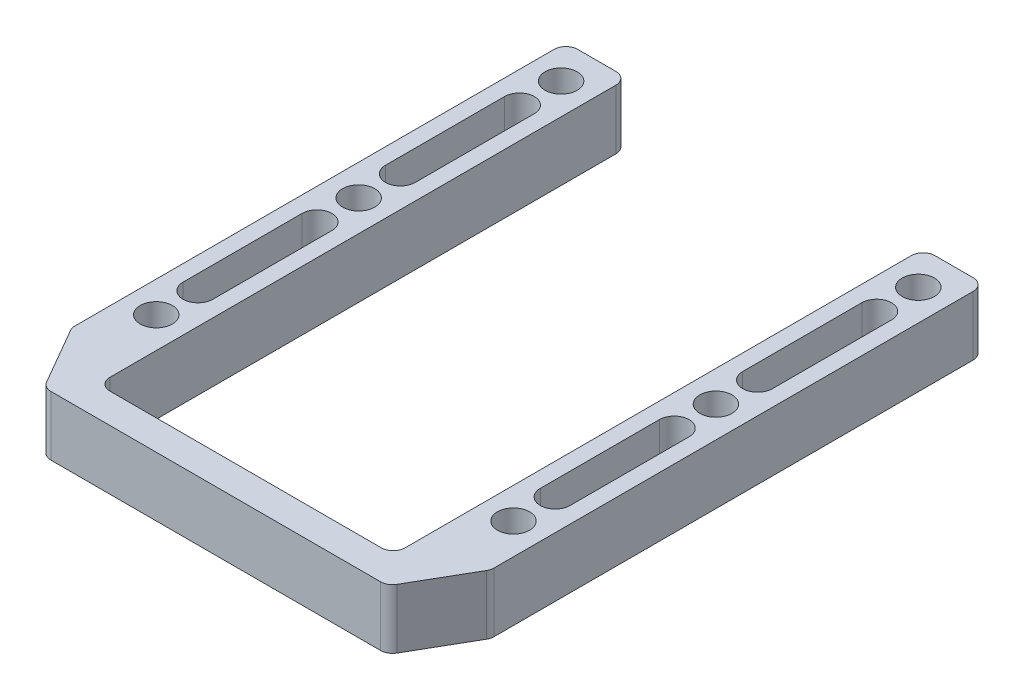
ISO-10303-21;
HEADER;
FILE_DESCRIPTION(('STEP AP214'),'2;1');
FILE_NAME('part.step','',(''),(''),'','','');
FILE_SCHEMA(('AUTOMOTIVE_DESIGN { 1 0 10303 214 1 1 1 1 }'));
ENDSEC;
DATA;
#1=APPLICATION_CONTEXT('core data for automotive mechanical design processes');
#2=APPLICATION_PROTOCOL_DEFINITION('international standard','automotive_design',2000,#1);
#3=PRODUCT_CONTEXT('',#1,'mechanical');
#4=PRODUCT('Part','Part','',(#3));
#5=PRODUCT_RELATED_PRODUCT_CATEGORY('part','',(#4));
#6=PRODUCT_DEFINITION_FORMATION('','',#4);
#7=PRODUCT_DEFINITION_CONTEXT('part definition',#1,'design');
#8=PRODUCT_DEFINITION('design','',#6,#7);
#9=PRODUCT_DEFINITION_SHAPE('','',#8);
#10=(LENGTH_UNIT() NAMED_UNIT(*) SI_UNIT(.MILLI.,.METRE.));
#11=(NAMED_UNIT(*) PLANE_ANGLE_UNIT() SI_UNIT($,.RADIAN.));
#12=(NAMED_UNIT(*) SI_UNIT($,.STERADIAN.) SOLID_ANGLE_UNIT());
#13=UNCERTAINTY_MEASURE_WITH_UNIT(LENGTH_MEASURE(1.E-05),#10,'distance_accuracy_value','');
#14=(GEOMETRIC_REPRESENTATION_CONTEXT(3) GLOBAL_UNCERTAINTY_ASSIGNED_CONTEXT((#13)) GLOBAL_UNIT_ASSIGNED_CONTEXT((#10,
#11,#12)) REPRESENTATION_CONTEXT('',''));
#15=CARTESIAN_POINT('',(0.,0.,0.));
#16=DIRECTION('',(0.,0.,1.));
#17=DIRECTION('',(1.,0.,0.));
#18=AXIS2_PLACEMENT_3D('',#15,#16,#17);
#19=CARTESIAN_POINT('',(48.4,20.5,11.));
#20=DIRECTION('',(0.,-1.,0.));
#21=DIRECTION('',(1.,0.,0.));
#22=AXIS2_PLACEMENT_3D('',#19,#20,#21);
#23=CYLINDRICAL_SURFACE('',#22,1.);
#24=DIRECTION('',(0.,1.,0.));
#25=VECTOR('',#24,1.);
#26=CARTESIAN_POINT('',(49.4,15.,11.));
#27=LINE('',#26,#25);
#28=CARTESIAN_POINT('',(49.4,15.,11.));
#29=VERTEX_POINT('',#28);
#30=CARTESIAN_POINT('',(49.4,20.,11.));
#31=VERTEX_POINT('',#30);
#32=EDGE_CURVE('E220',#29,#31,#27,.T.);
#33=ORIENTED_EDGE('',*,*,#32,.F.);
#34=CARTESIAN_POINT('',(48.4,15.,11.));
#35=DIRECTION('',(0.,-1.,0.));
#36=DIRECTION('',(1.,0.,0.));
#37=AXIS2_PLACEMENT_3D('',#34,#35,#36);
#38=CIRCLE('',#37,1.);
#39=CARTESIAN_POINT('',(48.4,15.,12.));
#40=VERTEX_POINT('',#39);
#41=EDGE_CURVE('E21',#40,#29,#38,.F.);
#42=ORIENTED_EDGE('',*,*,#41,.F.);
#43=DIRECTION('',(0.,1.,0.));
#44=VECTOR('',#43,1.);
#45=CARTESIAN_POINT('',(48.4,15.,12.));
#46=LINE('',#45,#44);
#47=CARTESIAN_POINT('',(48.4,20.,12.));
#48=VERTEX_POINT('',#47);
#49=EDGE_CURVE('E224',#48,#40,#46,.F.);
#50=ORIENTED_EDGE('',*,*,#49,.F.);
#51=CARTESIAN_POINT('',(48.4,20.,11.));
#52=DIRECTION('',(0.,-1.,0.));
#53=DIRECTION('',(1.,0.,0.));
#54=AXIS2_PLACEMENT_3D('',#51,#52,#53);
#55=CIRCLE('',#54,1.);
#56=EDGE_CURVE('E363',#31,#48,#55,.T.);
#57=ORIENTED_EDGE('',*,*,#56,.F.);
#58=EDGE_LOOP('',(#33,#42,#50,#57));
#59=FACE_BOUND('',#58,.T.);
#60=ADVANCED_FACE('F17',(#59),#23,.F.);
#61=CARTESIAN_POINT('',(50.4,14.5,-31.5));
#62=DIRECTION('',(0.,1.,0.));
#63=DIRECTION('',(0.,0.,1.));
#64=AXIS2_PLACEMENT_3D('',#61,#62,#63);
#65=CYLINDRICAL_SURFACE('',#64,1.);
#66=DIRECTION('',(0.,1.,0.));
#67=VECTOR('',#66,1.);
#68=CARTESIAN_POINT('',(50.4,15.,-32.5));
#69=LINE('',#68,#67);
#70=CARTESIAN_POINT('',(50.4,15.,-32.5));
#71=VERTEX_POINT('',#70);
#72=CARTESIAN_POINT('',(50.4,20.,-32.5));
#73=VERTEX_POINT('',#72);
#74=EDGE_CURVE('E215',#71,#73,#69,.T.);
#75=ORIENTED_EDGE('',*,*,#74,.F.);
#76=CARTESIAN_POINT('',(50.4,15.,-31.5));
#77=DIRECTION('',(0.,1.,0.));
#78=DIRECTION('',(0.,0.,1.));
#79=AXIS2_PLACEMENT_3D('',#76,#77,#78);
#80=CIRCLE('',#79,1.);
#81=CARTESIAN_POINT('',(49.4,15.,-31.5));
#82=VERTEX_POINT('',#81);
#83=EDGE_CURVE('E390',#71,#82,#80,.T.);
#84=ORIENTED_EDGE('',*,*,#83,.T.);
#85=DIRECTION('',(0.,1.,0.));
#86=VECTOR('',#85,1.);
#87=CARTESIAN_POINT('',(49.4,15.,-31.5));
#88=LINE('',#87,#86);
#89=CARTESIAN_POINT('',(49.4,20.,-31.5));
#90=VERTEX_POINT('',#89);
#91=EDGE_CURVE('E219',#90,#82,#88,.F.);
#92=ORIENTED_EDGE('',*,*,#91,.F.);
#93=CARTESIAN_POINT('',(50.4,20.,-31.5));
#94=DIRECTION('',(0.,1.,0.));
#95=DIRECTION('',(0.,0.,1.));
#96=AXIS2_PLACEMENT_3D('',#93,#94,#95);
#97=CIRCLE('',#96,1.);
#98=EDGE_CURVE('E365',#73,#90,#97,.T.);
#99=ORIENTED_EDGE('',*,*,#98,.F.);
#100=EDGE_LOOP('',(#75,#84,#92,#99));
#101=FACE_BOUND('',#100,.T.);
#102=ADVANCED_FACE('F617',(#101),#65,.T.);
#103=CARTESIAN_POINT('',(53.6,14.5,-31.5));
#104=DIRECTION('',(0.,1.,0.));
#105=DIRECTION('',(0.,0.,1.));
#106=AXIS2_PLACEMENT_3D('',#103,#104,#105);
#107=CYLINDRICAL_SURFACE('',#106,1.00000000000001);
#108=DIRECTION('',(0.,1.,0.));
#109=VECTOR('',#108,1.);
#110=CARTESIAN_POINT('',(54.6,15.,-31.5));
#111=LINE('',#110,#109);
#112=CARTESIAN_POINT('',(54.6,15.,-31.5));
#113=VERTEX_POINT('',#112);
#114=CARTESIAN_POINT('',(54.6,20.,-31.5));
#115=VERTEX_POINT('',#114);
#116=EDGE_CURVE('E210',#113,#115,#111,.T.);
#117=ORIENTED_EDGE('',*,*,#116,.F.);
#118=CARTESIAN_POINT('',(53.6,15.,-31.5));
#119=DIRECTION('',(0.,1.,0.));
#120=DIRECTION('',(0.,0.,1.));
#121=AXIS2_PLACEMENT_3D('',#118,#119,#120);
#122=CIRCLE('',#121,1.00000000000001);
#123=CARTESIAN_POINT('',(53.6,15.,-32.5));
#124=VERTEX_POINT('',#123);
#125=EDGE_CURVE('E389',#113,#124,#122,.T.);
#126=ORIENTED_EDGE('',*,*,#125,.T.);
#127=DIRECTION('',(0.,1.,0.));
#128=VECTOR('',#127,1.);
#129=CARTESIAN_POINT('',(53.6,15.,-32.5));
#130=LINE('',#129,#128);
#131=CARTESIAN_POINT('',(53.6,20.,-32.5));
#132=VERTEX_POINT('',#131);
#133=EDGE_CURVE('E214',#132,#124,#130,.F.);
#134=ORIENTED_EDGE('',*,*,#133,.F.);
#135=CARTESIAN_POINT('',(53.6,20.,-31.5));
#136=DIRECTION('',(0.,1.,0.));
#137=DIRECTION('',(0.,0.,1.));
#138=AXIS2_PLACEMENT_3D('',#135,#136,#137);
#139=CIRCLE('',#138,1.00000000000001);
#140=EDGE_CURVE('E367',#115,#132,#139,.T.);
#141=ORIENTED_EDGE('',*,*,#140,.F.);
#142=EDGE_LOOP('',(#117,#126,#134,#141));
#143=FACE_BOUND('',#142,.T.);
#144=ADVANCED_FACE('F614',(#143),#107,.T.);
#145=CARTESIAN_POINT('',(53.6000000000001,14.5,8.73205080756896));
#146=DIRECTION('',(0.,1.,0.));
#147=DIRECTION('',(0.,0.,1.));
#148=AXIS2_PLACEMENT_3D('',#145,#146,#147);
#149=CYLINDRICAL_SURFACE('',#148,0.999999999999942);
#150=DIRECTION('',(0.,1.,0.));
#151=VECTOR('',#150,1.);
#152=CARTESIAN_POINT('',(54.4660254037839,15.,9.23205080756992));
#153=LINE('',#152,#151);
#154=CARTESIAN_POINT('',(54.4660254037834,15.,9.23205080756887));
#155=VERTEX_POINT('',#154);
#156=CARTESIAN_POINT('',(54.4660254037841,20.,9.23205080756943));
#157=VERTEX_POINT('',#156);
#158=EDGE_CURVE('E205',#155,#157,#153,.T.);
#159=ORIENTED_EDGE('',*,*,#158,.F.);
#160=CARTESIAN_POINT('',(53.6000000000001,15.,8.73205080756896));
#161=DIRECTION('',(0.,1.,0.));
#162=DIRECTION('',(0.,0.,1.));
#163=AXIS2_PLACEMENT_3D('',#160,#161,#162);
#164=CIRCLE('',#163,0.999999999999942);
#165=CARTESIAN_POINT('',(54.6,15.,8.73205080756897));
#166=VERTEX_POINT('',#165);
#167=EDGE_CURVE('E387',#155,#166,#164,.T.);
#168=ORIENTED_EDGE('',*,*,#167,.T.);
#169=DIRECTION('',(0.,1.,0.));
#170=VECTOR('',#169,1.);
#171=CARTESIAN_POINT('',(54.6,15.,8.73205080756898));
#172=LINE('',#171,#170);
#173=CARTESIAN_POINT('',(54.6,20.,8.73205080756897));
#174=VERTEX_POINT('',#173);
#175=EDGE_CURVE('E209',#174,#166,#172,.F.);
#176=ORIENTED_EDGE('',*,*,#175,.F.);
#177=CARTESIAN_POINT('',(53.6000000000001,20.,8.73205080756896));
#178=DIRECTION('',(0.,1.,0.));
#179=DIRECTION('',(0.,0.,1.));
#180=AXIS2_PLACEMENT_3D('',#177,#178,#179);
#181=CIRCLE('',#180,0.999999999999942);
#182=EDGE_CURVE('E369',#157,#174,#181,.T.);
#183=ORIENTED_EDGE('',*,*,#182,.F.);
#184=EDGE_LOOP('',(#159,#168,#176,#183));
#185=FACE_BOUND('',#184,.T.);
#186=ADVANCED_FACE('F623',(#185),#149,.T.);
#187=CARTESIAN_POINT('',(50.84722325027,14.5,13.5000000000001));
#188=DIRECTION('',(0.,1.,0.));
#189=DIRECTION('',(0.,0.,1.));
#190=AXIS2_PLACEMENT_3D('',#187,#188,#189);
#191=CYLINDRICAL_SURFACE('',#190,0.999999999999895);
#192=DIRECTION('',(0.,1.,0.));
#193=VECTOR('',#192,1.);
#194=CARTESIAN_POINT('',(50.84722325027,15.,14.5));
#195=LINE('',#194,#193);
#196=CARTESIAN_POINT('',(50.84722325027,15.,14.5));
#197=VERTEX_POINT('',#196);
#198=CARTESIAN_POINT('',(50.84722325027,20.,14.5));
#199=VERTEX_POINT('',#198);
#200=EDGE_CURVE('E200',#197,#199,#195,.T.);
#201=ORIENTED_EDGE('',*,*,#200,.F.);
#202=CARTESIAN_POINT('',(50.84722325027,15.,13.5000000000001));
#203=DIRECTION('',(0.,1.,0.));
#204=DIRECTION('',(0.,0.,1.));
#205=AXIS2_PLACEMENT_3D('',#202,#203,#204);
#206=CIRCLE('',#205,0.999999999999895);
#207=CARTESIAN_POINT('',(51.713248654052,15.,13.9999999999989));
#208=VERTEX_POINT('',#207);
#209=EDGE_CURVE('E385',#197,#208,#206,.T.);
#210=ORIENTED_EDGE('',*,*,#209,.T.);
#211=DIRECTION('',(0.,1.,0.));
#212=VECTOR('',#211,1.);
#213=CARTESIAN_POINT('',(51.7132486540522,15.,13.9999999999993));
#214=LINE('',#213,#212);
#215=CARTESIAN_POINT('',(51.7132486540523,20.,13.9999999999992));
#216=VERTEX_POINT('',#215);
#217=EDGE_CURVE('E204',#216,#208,#214,.F.);
#218=ORIENTED_EDGE('',*,*,#217,.F.);
#219=CARTESIAN_POINT('',(50.84722325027,20.,13.5000000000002));
#220=DIRECTION('',(0.,1.,0.));
#221=DIRECTION('',(0.,0.,1.));
#222=AXIS2_PLACEMENT_3D('',#219,#220,#221);
#223=CIRCLE('',#222,0.999999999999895);
#224=EDGE_CURVE('E371',#199,#216,#223,.T.);
#225=ORIENTED_EDGE('',*,*,#224,.F.);
#226=EDGE_LOOP('',(#201,#210,#218,#225));
#227=FACE_BOUND('',#226,.T.);
#228=ADVANCED_FACE('F630',(#227),#191,.T.);
#229=CARTESIAN_POINT('',(23.15277674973,14.5,13.5000000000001));
#230=DIRECTION('',(0.,1.,0.));
#231=DIRECTION('',(0.,0.,1.));
#232=AXIS2_PLACEMENT_3D('',#229,#230,#231);
#233=CYLINDRICAL_SURFACE('',#232,0.999999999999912);
#234=DIRECTION('',(0.,1.,0.));
#235=VECTOR('',#234,1.);
#236=CARTESIAN_POINT('',(22.2867513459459,15.,14.0000000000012));
#237=LINE('',#236,#235);
#238=CARTESIAN_POINT('',(22.2867513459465,15.,14.0000000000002));
#239=VERTEX_POINT('',#238);
#240=CARTESIAN_POINT('',(22.2867513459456,20.,14.0000000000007));
#241=VERTEX_POINT('',#240);
#242=EDGE_CURVE('E195',#239,#241,#237,.T.);
#243=ORIENTED_EDGE('',*,*,#242,.F.);
#244=CARTESIAN_POINT('',(23.15277674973,15.,13.5000000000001));
#245=DIRECTION('',(0.,1.,0.));
#246=DIRECTION('',(0.,0.,1.));
#247=AXIS2_PLACEMENT_3D('',#244,#245,#246);
#248=CIRCLE('',#247,0.999999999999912);
#249=CARTESIAN_POINT('',(23.15277674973,15.,14.5));
#250=VERTEX_POINT('',#249);
#251=EDGE_CURVE('E383',#239,#250,#248,.T.);
#252=ORIENTED_EDGE('',*,*,#251,.T.);
#253=DIRECTION('',(0.,1.,0.));
#254=VECTOR('',#253,1.);
#255=CARTESIAN_POINT('',(23.15277674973,15.,14.5));
#256=LINE('',#255,#254);
#257=CARTESIAN_POINT('',(23.15277674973,20.,14.5));
#258=VERTEX_POINT('',#257);
#259=EDGE_CURVE('E199',#258,#250,#256,.F.);
#260=ORIENTED_EDGE('',*,*,#259,.F.);
#261=CARTESIAN_POINT('',(23.15277674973,20.,13.5000000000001));
#262=DIRECTION('',(0.,1.,0.));
#263=DIRECTION('',(0.,0.,1.));
#264=AXIS2_PLACEMENT_3D('',#261,#262,#263);
#265=CIRCLE('',#264,0.999999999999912);
#266=EDGE_CURVE('E373',#241,#258,#265,.T.);
#267=ORIENTED_EDGE('',*,*,#266,.F.);
#268=EDGE_LOOP('',(#243,#252,#260,#267));
#269=FACE_BOUND('',#268,.T.);
#270=ADVANCED_FACE('F634',(#269),#233,.T.);
#271=CARTESIAN_POINT('',(20.3999999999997,14.5,8.73205080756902));
#272=DIRECTION('',(0.,1.,0.));
#273=DIRECTION('',(0.,0.,1.));
#274=AXIS2_PLACEMENT_3D('',#271,#272,#273);
#275=CYLINDRICAL_SURFACE('',#274,0.99999999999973);
#276=DIRECTION('',(0.,1.,0.));
#277=VECTOR('',#276,1.);
#278=CARTESIAN_POINT('',(19.4,15.,8.73205080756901));
#279=LINE('',#278,#277);
#280=CARTESIAN_POINT('',(19.4,15.,8.73205080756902));
#281=VERTEX_POINT('',#280);
#282=CARTESIAN_POINT('',(19.4,20.,8.73205080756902));
#283=VERTEX_POINT('',#282);
#284=EDGE_CURVE('E190',#281,#283,#279,.T.);
#285=ORIENTED_EDGE('',*,*,#284,.F.);
#286=CARTESIAN_POINT('',(20.3999999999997,15.,8.73205080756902));
#287=DIRECTION('',(0.,1.,0.));
#288=DIRECTION('',(0.,0.,1.));
#289=AXIS2_PLACEMENT_3D('',#286,#287,#288);
#290=CIRCLE('',#289,0.99999999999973);
#291=CARTESIAN_POINT('',(19.5339745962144,15.,9.2320508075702));
#292=VERTEX_POINT('',#291);
#293=EDGE_CURVE('E381',#281,#292,#290,.T.);
#294=ORIENTED_EDGE('',*,*,#293,.T.);
#295=DIRECTION('',(0.,1.,0.));
#296=VECTOR('',#295,1.);
#297=CARTESIAN_POINT('',(19.5339745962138,15.,9.23205080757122));
#298=LINE('',#297,#296);
#299=CARTESIAN_POINT('',(19.5339745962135,20.,9.23205080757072));
#300=VERTEX_POINT('',#299);
#301=EDGE_CURVE('E194',#300,#292,#298,.F.);
#302=ORIENTED_EDGE('',*,*,#301,.F.);
#303=CARTESIAN_POINT('',(20.3999999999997,20.,8.73205080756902));
#304=DIRECTION('',(0.,1.,0.));
#305=DIRECTION('',(0.,0.,1.));
#306=AXIS2_PLACEMENT_3D('',#303,#304,#305);
#307=CIRCLE('',#306,0.99999999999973);
#308=EDGE_CURVE('E375',#283,#300,#307,.T.);
#309=ORIENTED_EDGE('',*,*,#308,.F.);
#310=EDGE_LOOP('',(#285,#294,#302,#309));
#311=FACE_BOUND('',#310,.T.);
#312=ADVANCED_FACE('F638',(#311),#275,.T.);
#313=CARTESIAN_POINT('',(20.4,14.5,-31.5));
#314=DIRECTION('',(0.,1.,0.));
#315=DIRECTION('',(0.,0.,1.));
#316=AXIS2_PLACEMENT_3D('',#313,#314,#315);
#317=CYLINDRICAL_SURFACE('',#316,1.);
#318=DIRECTION('',(0.,1.,0.));
#319=VECTOR('',#318,1.);
#320=CARTESIAN_POINT('',(20.4,15.,-32.5));
#321=LINE('',#320,#319);
#322=CARTESIAN_POINT('',(20.4,15.,-32.5));
#323=VERTEX_POINT('',#322);
#324=CARTESIAN_POINT('',(20.4,20.,-32.5));
#325=VERTEX_POINT('',#324);
#326=EDGE_CURVE('E180',#323,#325,#321,.T.);
#327=ORIENTED_EDGE('',*,*,#326,.F.);
#328=CARTESIAN_POINT('',(20.4,15.,-31.5));
#329=DIRECTION('',(0.,1.,0.));
#330=DIRECTION('',(0.,0.,1.));
#331=AXIS2_PLACEMENT_3D('',#328,#329,#330);
#332=CIRCLE('',#331,1.);
#333=CARTESIAN_POINT('',(19.4,15.,-31.5));
#334=VERTEX_POINT('',#333);
#335=EDGE_CURVE('E379',#323,#334,#332,.T.);
#336=ORIENTED_EDGE('',*,*,#335,.T.);
#337=DIRECTION('',(0.,1.,0.));
#338=VECTOR('',#337,1.);
#339=CARTESIAN_POINT('',(19.4,15.,-31.5));
#340=LINE('',#339,#338);
#341=CARTESIAN_POINT('',(19.4,20.,-31.5));
#342=VERTEX_POINT('',#341);
#343=EDGE_CURVE('E182',#342,#334,#340,.F.);
#344=ORIENTED_EDGE('',*,*,#343,.F.);
#345=CARTESIAN_POINT('',(20.4,20.,-31.5));
#346=DIRECTION('',(0.,1.,0.));
#347=DIRECTION('',(0.,0.,1.));
#348=AXIS2_PLACEMENT_3D('',#345,#346,#347);
#349=CIRCLE('',#348,1.);
#350=EDGE_CURVE('E169',#325,#342,#349,.T.);
#351=ORIENTED_EDGE('',*,*,#350,.F.);
#352=EDGE_LOOP('',(#327,#336,#344,#351));
#353=FACE_BOUND('',#352,.T.);
#354=ADVANCED_FACE('F642',(#353),#317,.T.);
#355=CARTESIAN_POINT('',(23.6,14.5,-31.5));
#356=DIRECTION('',(0.,1.,0.));
#357=DIRECTION('',(0.,0.,1.));
#358=AXIS2_PLACEMENT_3D('',#355,#356,#357);
#359=CYLINDRICAL_SURFACE('',#358,1.);
#360=DIRECTION('',(0.,1.,0.));
#361=VECTOR('',#360,1.);
#362=CARTESIAN_POINT('',(24.6,15.,-31.5));
#363=LINE('',#362,#361);
#364=CARTESIAN_POINT('',(24.6,15.,-31.5));
#365=VERTEX_POINT('',#364);
#366=CARTESIAN_POINT('',(24.6,20.,-31.5));
#367=VERTEX_POINT('',#366);
#368=EDGE_CURVE('E176',#365,#367,#363,.T.);
#369=ORIENTED_EDGE('',*,*,#368,.F.);
#370=CARTESIAN_POINT('',(23.6,15.,-31.5));
#371=DIRECTION('',(0.,1.,0.));
#372=DIRECTION('',(0.,0.,1.));
#373=AXIS2_PLACEMENT_3D('',#370,#371,#372);
#374=CIRCLE('',#373,1.);
#375=CARTESIAN_POINT('',(23.6,15.,-32.5));
#376=VERTEX_POINT('',#375);
#377=EDGE_CURVE('E35',#365,#376,#374,.T.);
#378=ORIENTED_EDGE('',*,*,#377,.T.);
#379=DIRECTION('',(0.,1.,0.));
#380=VECTOR('',#379,1.);
#381=CARTESIAN_POINT('',(23.6,15.,-32.5));
#382=LINE('',#381,#380);
#383=CARTESIAN_POINT('',(23.6,20.,-32.5));
#384=VERTEX_POINT('',#383);
#385=EDGE_CURVE('E172',#384,#376,#382,.F.);
#386=ORIENTED_EDGE('',*,*,#385,.F.);
#387=CARTESIAN_POINT('',(23.6,20.,-31.5));
#388=DIRECTION('',(0.,1.,0.));
#389=DIRECTION('',(0.,0.,1.));
#390=AXIS2_PLACEMENT_3D('',#387,#388,#389);
#391=CIRCLE('',#390,1.);
#392=EDGE_CURVE('E156',#367,#384,#391,.T.);
#393=ORIENTED_EDGE('',*,*,#392,.F.);
#394=EDGE_LOOP('',(#369,#378,#386,#393));
#395=FACE_BOUND('',#394,.T.);
#396=ADVANCED_FACE('F173',(#395),#359,.T.);
#397=CARTESIAN_POINT('',(54.6,20.,14.5));
#398=DIRECTION('',(0.,1.,0.));
#399=DIRECTION('',(0.,0.,1.));
#400=AXIS2_PLACEMENT_3D('',#397,#398,#399);
#401=PLANE('',#400);
#402=CARTESIAN_POINT('',(22.,20.,-26.));
#403=DIRECTION('',(0.,-1.,0.));
#404=DIRECTION('',(0.,0.,-1.));
#405=AXIS2_PLACEMENT_3D('',#402,#403,#404);
#406=CIRCLE('',#405,1.25);
#407=CARTESIAN_POINT('',(20.75,20.,-26.));
#408=VERTEX_POINT('',#407);
#409=CARTESIAN_POINT('',(23.25,20.,-26.));
#410=VERTEX_POINT('',#409);
#411=EDGE_CURVE('E357',#408,#410,#406,.T.);
#412=ORIENTED_EDGE('',*,*,#411,.T.);
#413=DIRECTION('',(0.,0.,1.));
#414=VECTOR('',#413,1.);
#415=CARTESIAN_POINT('',(23.25,20.,-16.));
#416=LINE('',#415,#414);
#417=CARTESIAN_POINT('',(23.25,20.,-16.));
#418=VERTEX_POINT('',#417);
#419=EDGE_CURVE('E255',#418,#410,#416,.F.);
#420=ORIENTED_EDGE('',*,*,#419,.F.);
#421=CARTESIAN_POINT('',(22.,20.,-16.));
#422=DIRECTION('',(0.,-1.,0.));
#423=DIRECTION('',(0.,0.,-1.));
#424=AXIS2_PLACEMENT_3D('',#421,#422,#423);
#425=CIRCLE('',#424,1.25);
#426=CARTESIAN_POINT('',(20.75,20.,-16.));
#427=VERTEX_POINT('',#426);
#428=EDGE_CURVE('E263',#418,#427,#425,.T.);
#429=ORIENTED_EDGE('',*,*,#428,.T.);
#430=DIRECTION('',(0.,0.,-1.));
#431=VECTOR('',#430,1.);
#432=CARTESIAN_POINT('',(20.75,20.,-26.));
#433=LINE('',#432,#431);
#434=EDGE_CURVE('E260',#408,#427,#433,.F.);
#435=ORIENTED_EDGE('',*,*,#434,.F.);
#436=EDGE_LOOP('',(#412,#420,#429,#435));
#437=FACE_BOUND('',#436,.T.);
#438=CARTESIAN_POINT('',(22.,20.,-9.));
#439=DIRECTION('',(0.,-1.,0.));
#440=DIRECTION('',(0.,0.,-1.));
#441=AXIS2_PLACEMENT_3D('',#438,#439,#440);
#442=CIRCLE('',#441,1.25);
#443=CARTESIAN_POINT('',(20.75,20.,-9.));
#444=VERTEX_POINT('',#443);
#445=CARTESIAN_POINT('',(23.25,20.,-9.));
#446=VERTEX_POINT('',#445);
#447=EDGE_CURVE('E351',#444,#446,#442,.T.);
#448=ORIENTED_EDGE('',*,*,#447,.T.);
#449=DIRECTION('',(0.,0.,1.));
#450=VECTOR('',#449,1.);
#451=CARTESIAN_POINT('',(23.25,20.,1.));
#452=LINE('',#451,#450);
#453=CARTESIAN_POINT('',(23.25,20.,1.));
#454=VERTEX_POINT('',#453);
#455=EDGE_CURVE('E246',#454,#446,#452,.F.);
#456=ORIENTED_EDGE('',*,*,#455,.F.);
#457=CARTESIAN_POINT('',(22.,20.,1.));
#458=DIRECTION('',(0.,-1.,0.));
#459=DIRECTION('',(0.,0.,-1.));
#460=AXIS2_PLACEMENT_3D('',#457,#458,#459);
#461=CIRCLE('',#460,1.25);
#462=CARTESIAN_POINT('',(20.75,20.,1.));
#463=VERTEX_POINT('',#462);
#464=EDGE_CURVE('E253',#454,#463,#461,.T.);
#465=ORIENTED_EDGE('',*,*,#464,.T.);
#466=DIRECTION('',(0.,0.,-1.));
#467=VECTOR('',#466,1.);
#468=CARTESIAN_POINT('',(20.75,20.,-9.));
#469=LINE('',#468,#467);
#470=EDGE_CURVE('E250',#444,#463,#469,.F.);
#471=ORIENTED_EDGE('',*,*,#470,.F.);
#472=EDGE_LOOP('',(#448,#456,#465,#471));
#473=FACE_BOUND('',#472,.T.);
#474=DIRECTION('',(0.,0.,-1.));
#475=VECTOR('',#474,1.);
#476=CARTESIAN_POINT('',(50.75,20.,-26.));
#477=LINE('',#476,#475);
#478=CARTESIAN_POINT('',(50.75,20.,-26.));
#479=VERTEX_POINT('',#478);
#480=CARTESIAN_POINT('',(50.75,20.,-16.));
#481=VERTEX_POINT('',#480);
#482=EDGE_CURVE('E241',#479,#481,#477,.F.);
#483=ORIENTED_EDGE('',*,*,#482,.F.);
#484=CARTESIAN_POINT('',(52.,20.,-26.));
#485=DIRECTION('',(0.,-1.,0.));
#486=DIRECTION('',(0.,0.,-1.));
#487=AXIS2_PLACEMENT_3D('',#484,#485,#486);
#488=CIRCLE('',#487,1.25);
#489=CARTESIAN_POINT('',(53.25,20.,-26.));
#490=VERTEX_POINT('',#489);
#491=EDGE_CURVE('E342',#479,#490,#488,.T.);
#492=ORIENTED_EDGE('',*,*,#491,.T.);
#493=DIRECTION('',(0.,0.,1.));
#494=VECTOR('',#493,1.);
#495=CARTESIAN_POINT('',(53.25,20.,-16.));
#496=LINE('',#495,#494);
#497=CARTESIAN_POINT('',(53.25,20.,-16.));
#498=VERTEX_POINT('',#497);
#499=EDGE_CURVE('E236',#498,#490,#496,.F.);
#500=ORIENTED_EDGE('',*,*,#499,.F.);
#501=CARTESIAN_POINT('',(52.,20.,-16.));
#502=DIRECTION('',(0.,-1.,0.));
#503=DIRECTION('',(0.,0.,-1.));
#504=AXIS2_PLACEMENT_3D('',#501,#502,#503);
#505=CIRCLE('',#504,1.25);
#506=EDGE_CURVE('E244',#498,#481,#505,.T.);
#507=ORIENTED_EDGE('',*,*,#506,.T.);
#508=EDGE_LOOP('',(#483,#492,#500,#507));
#509=FACE_BOUND('',#508,.T.);
#510=DIRECTION('',(0.,0.,-1.));
#511=VECTOR('',#510,1.);
#512=CARTESIAN_POINT('',(50.75,20.,-9.));
#513=LINE('',#512,#511);
#514=CARTESIAN_POINT('',(50.75,20.,-9.));
#515=VERTEX_POINT('',#514);
#516=CARTESIAN_POINT('',(50.75,20.,1.));
#517=VERTEX_POINT('',#516);
#518=EDGE_CURVE('E231',#515,#517,#513,.F.);
#519=ORIENTED_EDGE('',*,*,#518,.F.);
#520=CARTESIAN_POINT('',(52.,20.,-9.));
#521=DIRECTION('',(0.,-1.,0.));
#522=DIRECTION('',(0.,0.,-1.));
#523=AXIS2_PLACEMENT_3D('',#520,#521,#522);
#524=CIRCLE('',#523,1.25);
#525=CARTESIAN_POINT('',(53.25,20.,-9.));
#526=VERTEX_POINT('',#525);
#527=EDGE_CURVE('E336',#515,#526,#524,.T.);
#528=ORIENTED_EDGE('',*,*,#527,.T.);
#529=DIRECTION('',(0.,0.,1.));
#530=VECTOR('',#529,1.);
#531=CARTESIAN_POINT('',(53.25,20.,1.));
#532=LINE('',#531,#530);
#533=CARTESIAN_POINT('',(53.25,20.,0.999999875));
#534=VERTEX_POINT('',#533);
#535=EDGE_CURVE('E226',#534,#526,#532,.F.);
#536=ORIENTED_EDGE('',*,*,#535,.F.);
#537=CARTESIAN_POINT('',(52.,20.,1.));
#538=DIRECTION('',(0.,-1.,0.));
#539=DIRECTION('',(0.,0.,-1.));
#540=AXIS2_PLACEMENT_3D('',#537,#538,#539);
#541=CIRCLE('',#540,1.25);
#542=EDGE_CURVE('E234',#534,#517,#541,.T.);
#543=ORIENTED_EDGE('',*,*,#542,.T.);
#544=EDGE_LOOP('',(#519,#528,#536,#543));
#545=FACE_BOUND('',#544,.T.);
#546=CARTESIAN_POINT('',(22.,20.,-12.5));
#547=DIRECTION('',(0.,-1.,0.));
#548=DIRECTION('',(0.,0.,-1.));
#549=AXIS2_PLACEMENT_3D('',#546,#547,#548);
#550=CIRCLE('',#549,1.35);
#551=CARTESIAN_POINT('',(22.,20.,-13.85));
#552=VERTEX_POINT('',#551);
#553=EDGE_CURVE('E332',#552,#552,#550,.T.);
#554=ORIENTED_EDGE('',*,*,#553,.T.);
#555=EDGE_LOOP('',(#554));
#556=FACE_BOUND('',#555,.T.);
#557=CARTESIAN_POINT('',(22.,20.,4.5));
#558=DIRECTION('',(0.,-1.,0.));
#559=DIRECTION('',(0.,0.,-1.));
#560=AXIS2_PLACEMENT_3D('',#557,#558,#559);
#561=CIRCLE('',#560,1.35);
#562=CARTESIAN_POINT('',(22.,20.,3.15));
#563=VERTEX_POINT('',#562);
#564=EDGE_CURVE('E329',#563,#563,#561,.T.);
#565=ORIENTED_EDGE('',*,*,#564,.T.);
#566=EDGE_LOOP('',(#565));
#567=FACE_BOUND('',#566,.T.);
#568=CARTESIAN_POINT('',(22.,20.,-29.5));
#569=DIRECTION('',(0.,-1.,0.));
#570=DIRECTION('',(0.,0.,-1.));
#571=AXIS2_PLACEMENT_3D('',#568,#569,#570);
#572=CIRCLE('',#571,1.35);
#573=CARTESIAN_POINT('',(22.,20.,-30.85));
#574=VERTEX_POINT('',#573);
#575=EDGE_CURVE('E326',#574,#574,#572,.T.);
#576=ORIENTED_EDGE('',*,*,#575,.T.);
#577=EDGE_LOOP('',(#576));
#578=FACE_BOUND('',#577,.T.);
#579=CARTESIAN_POINT('',(52.,20.,-12.5));
#580=DIRECTION('',(0.,-1.,0.));
#581=DIRECTION('',(0.,0.,-1.));
#582=AXIS2_PLACEMENT_3D('',#579,#580,#581);
#583=CIRCLE('',#582,1.35);
#584=CARTESIAN_POINT('',(52.,20.,-13.85));
#585=VERTEX_POINT('',#584);
#586=EDGE_CURVE('E323',#585,#585,#583,.T.);
#587=ORIENTED_EDGE('',*,*,#586,.T.);
#588=EDGE_LOOP('',(#587));
#589=FACE_BOUND('',#588,.T.);
#590=CARTESIAN_POINT('',(52.,20.,4.5));
#591=DIRECTION('',(0.,-1.,0.));
#592=DIRECTION('',(0.,0.,-1.));
#593=AXIS2_PLACEMENT_3D('',#590,#591,#592);
#594=CIRCLE('',#593,1.35);
#595=CARTESIAN_POINT('',(52.,20.,3.15));
#596=VERTEX_POINT('',#595);
#597=EDGE_CURVE('E320',#596,#596,#594,.T.);
#598=ORIENTED_EDGE('',*,*,#597,.T.);
#599=EDGE_LOOP('',(#598));
#600=FACE_BOUND('',#599,.T.);
#601=CARTESIAN_POINT('',(52.,20.,-29.5));
#602=DIRECTION('',(0.,-1.,0.));
#603=DIRECTION('',(0.,0.,-1.));
#604=AXIS2_PLACEMENT_3D('',#601,#602,#603);
#605=CIRCLE('',#604,1.35);
#606=CARTESIAN_POINT('',(52.,20.,-30.85));
#607=VERTEX_POINT('',#606);
#608=EDGE_CURVE('E317',#607,#607,#605,.T.);
#609=ORIENTED_EDGE('',*,*,#608,.T.);
#610=EDGE_LOOP('',(#609));
#611=FACE_BOUND('',#610,.T.);
#612=ORIENTED_EDGE('',*,*,#56,.T.);
#613=DIRECTION('',(-1.,0.,0.));
#614=VECTOR('',#613,1.);
#615=CARTESIAN_POINT('',(48.4,20.,12.));
#616=LINE('',#615,#614);
#617=CARTESIAN_POINT('',(25.6,20.,12.));
#618=VERTEX_POINT('',#617);
#619=EDGE_CURVE('E221',#618,#48,#616,.F.);
#620=ORIENTED_EDGE('',*,*,#619,.F.);
#621=CARTESIAN_POINT('',(25.6,20.,11.));
#622=DIRECTION('',(0.,-1.,0.));
#623=DIRECTION('',(1.,0.,0.));
#624=AXIS2_PLACEMENT_3D('',#621,#622,#623);
#625=CIRCLE('',#624,0.999999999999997);
#626=CARTESIAN_POINT('',(24.6,20.,11.));
#627=VERTEX_POINT('',#626);
#628=EDGE_CURVE('E360',#618,#627,#625,.T.);
#629=ORIENTED_EDGE('',*,*,#628,.T.);
#630=DIRECTION('',(0.,0.,-1.));
#631=VECTOR('',#630,1.);
#632=CARTESIAN_POINT('',(24.6,20.,11.));
#633=LINE('',#632,#631);
#634=EDGE_CURVE('E167',#367,#627,#633,.F.);
#635=ORIENTED_EDGE('',*,*,#634,.F.);
#636=ORIENTED_EDGE('',*,*,#392,.T.);
#637=DIRECTION('',(-1.,0.,0.));
#638=VECTOR('',#637,1.);
#639=CARTESIAN_POINT('',(23.6,20.,-32.5));
#640=LINE('',#639,#638);
#641=EDGE_CURVE('E164',#325,#384,#640,.F.);
#642=ORIENTED_EDGE('',*,*,#641,.F.);
#643=ORIENTED_EDGE('',*,*,#350,.T.);
#644=DIRECTION('',(0.,0.,1.));
#645=VECTOR('',#644,1.);
#646=CARTESIAN_POINT('',(19.4,20.,-31.5));
#647=LINE('',#646,#645);
#648=EDGE_CURVE('E187',#283,#342,#647,.F.);
#649=ORIENTED_EDGE('',*,*,#648,.F.);
#650=ORIENTED_EDGE('',*,*,#308,.T.);
#651=DIRECTION('',(0.50000000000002,0.,0.866025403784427));
#652=VECTOR('',#651,1.);
#653=CARTESIAN_POINT('',(19.5339745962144,20.,9.23205080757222));
#654=LINE('',#653,#652);
#655=EDGE_CURVE('E191',#241,#300,#654,.F.);
#656=ORIENTED_EDGE('',*,*,#655,.F.);
#657=ORIENTED_EDGE('',*,*,#266,.T.);
#658=DIRECTION('',(1.,0.,0.));
#659=VECTOR('',#658,1.);
#660=CARTESIAN_POINT('',(23.15277674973,20.,14.5));
#661=LINE('',#660,#659);
#662=EDGE_CURVE('E196',#199,#258,#661,.F.);
#663=ORIENTED_EDGE('',*,*,#662,.F.);
#664=ORIENTED_EDGE('',*,*,#224,.T.);
#665=DIRECTION('',(0.500000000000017,0.,-0.866025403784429));
#666=VECTOR('',#665,1.);
#667=CARTESIAN_POINT('',(51.7132486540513,20.,14.0000000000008));
#668=LINE('',#667,#666);
#669=EDGE_CURVE('E201',#157,#216,#668,.F.);
#670=ORIENTED_EDGE('',*,*,#669,.F.);
#671=ORIENTED_EDGE('',*,*,#182,.T.);
#672=DIRECTION('',(0.,0.,-1.));
#673=VECTOR('',#672,1.);
#674=CARTESIAN_POINT('',(54.6,20.,8.732050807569));
#675=LINE('',#674,#673);
#676=EDGE_CURVE('E206',#115,#174,#675,.F.);
#677=ORIENTED_EDGE('',*,*,#676,.F.);
#678=ORIENTED_EDGE('',*,*,#140,.T.);
#679=DIRECTION('',(-1.,0.,0.));
#680=VECTOR('',#679,1.);
#681=CARTESIAN_POINT('',(53.6,20.,-32.5));
#682=LINE('',#681,#680);
#683=EDGE_CURVE('E211',#73,#132,#682,.F.);
#684=ORIENTED_EDGE('',*,*,#683,.F.);
#685=ORIENTED_EDGE('',*,*,#98,.T.);
#686=DIRECTION('',(0.,0.,1.));
#687=VECTOR('',#686,1.);
#688=CARTESIAN_POINT('',(49.4,20.,-31.5));
#689=LINE('',#688,#687);
#690=EDGE_CURVE('E216',#31,#90,#689,.F.);
#691=ORIENTED_EDGE('',*,*,#690,.F.);
#692=EDGE_LOOP('',(#612,#620,#629,#635,#636,#642,#643,#649,#650,#656,#657,#663,#664,#670,#671,
#677,#678,#684,#685,#691));
#693=FACE_BOUND('',#692,.T.);
#694=ADVANCED_FACE('F162',(#437,#473,#509,#545,#556,#567,#578,#589,#600,#611,#693),#401,.T.);
#695=CARTESIAN_POINT('',(25.6,20.5,11.));
#696=DIRECTION('',(0.,-1.,0.));
#697=DIRECTION('',(1.,0.,0.));
#698=AXIS2_PLACEMENT_3D('',#695,#696,#697);
#699=CYLINDRICAL_SURFACE('',#698,0.999999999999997);
#700=DIRECTION('',(0.,1.,0.));
#701=VECTOR('',#700,1.);
#702=CARTESIAN_POINT('',(25.6,15.,12.));
#703=LINE('',#702,#701);
#704=CARTESIAN_POINT('',(25.6,15.,12.));
#705=VERTEX_POINT('',#704);
#706=EDGE_CURVE('E225',#705,#618,#703,.T.);
#707=ORIENTED_EDGE('',*,*,#706,.F.);
#708=CARTESIAN_POINT('',(25.6,15.,11.));
#709=DIRECTION('',(0.,-1.,0.));
#710=DIRECTION('',(1.,0.,0.));
#711=AXIS2_PLACEMENT_3D('',#708,#709,#710);
#712=CIRCLE('',#711,0.999999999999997);
#713=CARTESIAN_POINT('',(24.6,15.,11.));
#714=VERTEX_POINT('',#713);
#715=EDGE_CURVE('E96',#714,#705,#712,.F.);
#716=ORIENTED_EDGE('',*,*,#715,.F.);
#717=DIRECTION('',(0.,1.,0.));
#718=VECTOR('',#717,1.);
#719=CARTESIAN_POINT('',(24.6,15.,11.));
#720=LINE('',#719,#718);
#721=EDGE_CURVE('E316',#627,#714,#720,.F.);
#722=ORIENTED_EDGE('',*,*,#721,.F.);
#723=ORIENTED_EDGE('',*,*,#628,.F.);
#724=EDGE_LOOP('',(#707,#716,#722,#723));
#725=FACE_BOUND('',#724,.T.);
#726=ADVANCED_FACE('F552',(#725),#699,.F.);
#727=CARTESIAN_POINT('',(22.,20.5,-26.));
#728=DIRECTION('',(0.,-1.,0.));
#729=DIRECTION('',(0.,0.,-1.));
#730=AXIS2_PLACEMENT_3D('',#727,#728,#729);
#731=CYLINDRICAL_SURFACE('',#730,1.25);
#732=ORIENTED_EDGE('',*,*,#411,.F.);
#733=DIRECTION('',(0.,1.,0.));
#734=VECTOR('',#733,1.);
#735=CARTESIAN_POINT('',(20.75,15.,-26.));
#736=LINE('',#735,#734);
#737=CARTESIAN_POINT('',(20.75,15.,-26.));
#738=VERTEX_POINT('',#737);
#739=EDGE_CURVE('E264',#738,#408,#736,.T.);
#740=ORIENTED_EDGE('',*,*,#739,.F.);
#741=CARTESIAN_POINT('',(22.,15.,-26.));
#742=DIRECTION('',(0.,-1.,0.));
#743=DIRECTION('',(0.,0.,-1.));
#744=AXIS2_PLACEMENT_3D('',#741,#742,#743);
#745=CIRCLE('',#744,1.25);
#746=CARTESIAN_POINT('',(23.25,15.,-26.));
#747=VERTEX_POINT('',#746);
#748=EDGE_CURVE('E313',#747,#738,#745,.F.);
#749=ORIENTED_EDGE('',*,*,#748,.F.);
#750=DIRECTION('',(0.,1.,0.));
#751=VECTOR('',#750,1.);
#752=CARTESIAN_POINT('',(23.25,15.,-26.));
#753=LINE('',#752,#751);
#754=EDGE_CURVE('E258',#410,#747,#753,.F.);
#755=ORIENTED_EDGE('',*,*,#754,.F.);
#756=EDGE_LOOP('',(#732,#740,#749,#755));
#757=FACE_BOUND('',#756,.T.);
#758=ADVANCED_FACE('F503',(#757),#731,.F.);
#759=CARTESIAN_POINT('',(20.75,15.,-26.));
#760=DIRECTION('',(1.,0.,0.));
#761=DIRECTION('',(0.,0.,-1.));
#762=AXIS2_PLACEMENT_3D('',#759,#760,#761);
#763=PLANE('',#762);
#764=DIRECTION('',(0.,-1.,0.));
#765=VECTOR('',#764,1.);
#766=CARTESIAN_POINT('',(20.75,20.5,-16.));
#767=LINE('',#766,#765);
#768=CARTESIAN_POINT('',(20.75,15.,-16.));
#769=VERTEX_POINT('',#768);
#770=EDGE_CURVE('E356',#427,#769,#767,.T.);
#771=ORIENTED_EDGE('',*,*,#770,.T.);
#772=DIRECTION('',(0.,0.,-1.));
#773=VECTOR('',#772,1.);
#774=CARTESIAN_POINT('',(20.75,15.,14.5));
#775=LINE('',#774,#773);
#776=EDGE_CURVE('E312',#738,#769,#775,.F.);
#777=ORIENTED_EDGE('',*,*,#776,.F.);
#778=ORIENTED_EDGE('',*,*,#739,.T.);
#779=ORIENTED_EDGE('',*,*,#434,.T.);
#780=EDGE_LOOP('',(#771,#777,#778,#779));
#781=FACE_BOUND('',#780,.T.);
#782=ADVANCED_FACE('F494',(#781),#763,.T.);
#783=CARTESIAN_POINT('',(22.,20.5,-16.));
#784=DIRECTION('',(0.,-1.,0.));
#785=DIRECTION('',(0.,0.,-1.));
#786=AXIS2_PLACEMENT_3D('',#783,#784,#785);
#787=CYLINDRICAL_SURFACE('',#786,1.25);
#788=ORIENTED_EDGE('',*,*,#428,.F.);
#789=DIRECTION('',(0.,1.,0.));
#790=VECTOR('',#789,1.);
#791=CARTESIAN_POINT('',(23.25,15.,-16.));
#792=LINE('',#791,#790);
#793=CARTESIAN_POINT('',(23.25,15.,-16.));
#794=VERTEX_POINT('',#793);
#795=EDGE_CURVE('E259',#794,#418,#792,.T.);
#796=ORIENTED_EDGE('',*,*,#795,.F.);
#797=CARTESIAN_POINT('',(22.,15.,-16.));
#798=DIRECTION('',(0.,-1.,0.));
#799=DIRECTION('',(0.,0.,-1.));
#800=AXIS2_PLACEMENT_3D('',#797,#798,#799);
#801=CIRCLE('',#800,1.25);
#802=EDGE_CURVE('E309',#769,#794,#801,.F.);
#803=ORIENTED_EDGE('',*,*,#802,.F.);
#804=ORIENTED_EDGE('',*,*,#770,.F.);
#805=EDGE_LOOP('',(#788,#796,#803,#804));
#806=FACE_BOUND('',#805,.T.);
#807=ADVANCED_FACE('F658',(#806),#787,.F.);
#808=CARTESIAN_POINT('',(23.25,15.,-16.));
#809=DIRECTION('',(-1.,0.,0.));
#810=DIRECTION('',(0.,0.,1.));
#811=AXIS2_PLACEMENT_3D('',#808,#809,#810);
#812=PLANE('',#811);
#813=ORIENTED_EDGE('',*,*,#754,.T.);
#814=DIRECTION('',(0.,0.,-1.));
#815=VECTOR('',#814,1.);
#816=CARTESIAN_POINT('',(23.25,15.,14.5));
#817=LINE('',#816,#815);
#818=EDGE_CURVE('E308',#794,#747,#817,.T.);
#819=ORIENTED_EDGE('',*,*,#818,.F.);
#820=ORIENTED_EDGE('',*,*,#795,.T.);
#821=ORIENTED_EDGE('',*,*,#419,.T.);
#822=EDGE_LOOP('',(#813,#819,#820,#821));
#823=FACE_BOUND('',#822,.T.);
#824=ADVANCED_FACE('F661',(#823),#812,.T.);
#825=CARTESIAN_POINT('',(22.,20.5,-9.));
#826=DIRECTION('',(0.,-1.,0.));
#827=DIRECTION('',(0.,0.,-1.));
#828=AXIS2_PLACEMENT_3D('',#825,#826,#827);
#829=CYLINDRICAL_SURFACE('',#828,1.25);
#830=ORIENTED_EDGE('',*,*,#447,.F.);
#831=DIRECTION('',(0.,1.,0.));
#832=VECTOR('',#831,1.);
#833=CARTESIAN_POINT('',(20.75,15.,-9.));
#834=LINE('',#833,#832);
#835=CARTESIAN_POINT('',(20.75,15.,-9.));
#836=VERTEX_POINT('',#835);
#837=EDGE_CURVE('E254',#836,#444,#834,.T.);
#838=ORIENTED_EDGE('',*,*,#837,.F.);
#839=CARTESIAN_POINT('',(22.,15.,-9.));
#840=DIRECTION('',(0.,-1.,0.));
#841=DIRECTION('',(0.,0.,-1.));
#842=AXIS2_PLACEMENT_3D('',#839,#840,#841);
#843=CIRCLE('',#842,1.25);
#844=CARTESIAN_POINT('',(23.25,15.,-9.));
#845=VERTEX_POINT('',#844);
#846=EDGE_CURVE('E305',#845,#836,#843,.F.);
#847=ORIENTED_EDGE('',*,*,#846,.F.);
#848=DIRECTION('',(0.,1.,0.));
#849=VECTOR('',#848,1.);
#850=CARTESIAN_POINT('',(23.25,15.,-9.));
#851=LINE('',#850,#849);
#852=EDGE_CURVE('E245',#446,#845,#851,.F.);
#853=ORIENTED_EDGE('',*,*,#852,.F.);
#854=EDGE_LOOP('',(#830,#838,#847,#853));
#855=FACE_BOUND('',#854,.T.);
#856=ADVANCED_FACE('F665',(#855),#829,.F.);
#857=CARTESIAN_POINT('',(20.75,15.,-9.));
#858=DIRECTION('',(1.,0.,0.));
#859=DIRECTION('',(0.,0.,-1.));
#860=AXIS2_PLACEMENT_3D('',#857,#858,#859);
#861=PLANE('',#860);
#862=DIRECTION('',(0.,-1.,0.));
#863=VECTOR('',#862,1.);
#864=CARTESIAN_POINT('',(20.75,20.5,1.));
#865=LINE('',#864,#863);
#866=CARTESIAN_POINT('',(20.75,15.,1.));
#867=VERTEX_POINT('',#866);
#868=EDGE_CURVE('E350',#463,#867,#865,.T.);
#869=ORIENTED_EDGE('',*,*,#868,.T.);
#870=DIRECTION('',(0.,0.,-1.));
#871=VECTOR('',#870,1.);
#872=CARTESIAN_POINT('',(20.75,15.,14.5));
#873=LINE('',#872,#871);
#874=EDGE_CURVE('E304',#836,#867,#873,.F.);
#875=ORIENTED_EDGE('',*,*,#874,.F.);
#876=ORIENTED_EDGE('',*,*,#837,.T.);
#877=ORIENTED_EDGE('',*,*,#470,.T.);
#878=EDGE_LOOP('',(#869,#875,#876,#877));
#879=FACE_BOUND('',#878,.T.);
#880=ADVANCED_FACE('F669',(#879),#861,.T.);
#881=CARTESIAN_POINT('',(22.,20.5,1.));
#882=DIRECTION('',(0.,-1.,0.));
#883=DIRECTION('',(0.,0.,-1.));
#884=AXIS2_PLACEMENT_3D('',#881,#882,#883);
#885=CYLINDRICAL_SURFACE('',#884,1.25);
#886=ORIENTED_EDGE('',*,*,#464,.F.);
#887=DIRECTION('',(0.,1.,0.));
#888=VECTOR('',#887,1.);
#889=CARTESIAN_POINT('',(23.25,15.,1.));
#890=LINE('',#889,#888);
#891=CARTESIAN_POINT('',(23.25,15.,1.));
#892=VERTEX_POINT('',#891);
#893=EDGE_CURVE('E249',#892,#454,#890,.T.);
#894=ORIENTED_EDGE('',*,*,#893,.F.);
#895=CARTESIAN_POINT('',(22.,15.,1.));
#896=DIRECTION('',(0.,-1.,0.));
#897=DIRECTION('',(0.,0.,-1.));
#898=AXIS2_PLACEMENT_3D('',#895,#896,#897);
#899=CIRCLE('',#898,1.25);
#900=EDGE_CURVE('E300',#867,#892,#899,.F.);
#901=ORIENTED_EDGE('',*,*,#900,.F.);
#902=ORIENTED_EDGE('',*,*,#868,.F.);
#903=EDGE_LOOP('',(#886,#894,#901,#902));
#904=FACE_BOUND('',#903,.T.);
#905=ADVANCED_FACE('F673',(#904),#885,.F.);
#906=CARTESIAN_POINT('',(23.25,15.,1.));
#907=DIRECTION('',(-1.,0.,0.));
#908=DIRECTION('',(0.,0.,1.));
#909=AXIS2_PLACEMENT_3D('',#906,#907,#908);
#910=PLANE('',#909);
#911=ORIENTED_EDGE('',*,*,#852,.T.);
#912=DIRECTION('',(0.,0.,-1.));
#913=VECTOR('',#912,1.);
#914=CARTESIAN_POINT('',(23.25,15.,14.5));
#915=LINE('',#914,#913);
#916=EDGE_CURVE('E303',#892,#845,#915,.T.);
#917=ORIENTED_EDGE('',*,*,#916,.F.);
#918=ORIENTED_EDGE('',*,*,#893,.T.);
#919=ORIENTED_EDGE('',*,*,#455,.T.);
#920=EDGE_LOOP('',(#911,#917,#918,#919));
#921=FACE_BOUND('',#920,.T.);
#922=ADVANCED_FACE('F677',(#921),#910,.T.);
#923=CARTESIAN_POINT('',(50.75,15.,-26.));
#924=DIRECTION('',(1.,0.,0.));
#925=DIRECTION('',(0.,0.,-1.));
#926=AXIS2_PLACEMENT_3D('',#923,#924,#925);
#927=PLANE('',#926);
#928=DIRECTION('',(0.,-1.,0.));
#929=VECTOR('',#928,1.);
#930=CARTESIAN_POINT('',(50.75,20.5,-16.));
#931=LINE('',#930,#929);
#932=CARTESIAN_POINT('',(50.75,15.,-16.));
#933=VERTEX_POINT('',#932);
#934=EDGE_CURVE('E347',#481,#933,#931,.T.);
#935=ORIENTED_EDGE('',*,*,#934,.T.);
#936=DIRECTION('',(0.,0.,-1.));
#937=VECTOR('',#936,1.);
#938=CARTESIAN_POINT('',(50.75,15.,14.5));
#939=LINE('',#938,#937);
#940=CARTESIAN_POINT('',(50.75,15.,-26.));
#941=VERTEX_POINT('',#940);
#942=EDGE_CURVE('E299',#941,#933,#939,.F.);
#943=ORIENTED_EDGE('',*,*,#942,.F.);
#944=DIRECTION('',(0.,-1.,0.));
#945=VECTOR('',#944,1.);
#946=CARTESIAN_POINT('',(50.75,20.5,-26.));
#947=LINE('',#946,#945);
#948=EDGE_CURVE('E239',#941,#479,#947,.F.);
#949=ORIENTED_EDGE('',*,*,#948,.T.);
#950=ORIENTED_EDGE('',*,*,#482,.T.);
#951=EDGE_LOOP('',(#935,#943,#949,#950));
#952=FACE_BOUND('',#951,.T.);
#953=ADVANCED_FACE('F681',(#952),#927,.T.);
#954=CARTESIAN_POINT('',(52.,20.5,-16.));
#955=DIRECTION('',(0.,-1.,0.));
#956=DIRECTION('',(0.,0.,-1.));
#957=AXIS2_PLACEMENT_3D('',#954,#955,#956);
#958=CYLINDRICAL_SURFACE('',#957,1.25);
#959=ORIENTED_EDGE('',*,*,#506,.F.);
#960=DIRECTION('',(0.,1.,0.));
#961=VECTOR('',#960,1.);
#962=CARTESIAN_POINT('',(53.25,15.,-16.));
#963=LINE('',#962,#961);
#964=CARTESIAN_POINT('',(53.25,15.,-16.));
#965=VERTEX_POINT('',#964);
#966=EDGE_CURVE('E240',#965,#498,#963,.T.);
#967=ORIENTED_EDGE('',*,*,#966,.F.);
#968=CARTESIAN_POINT('',(52.,15.,-16.));
#969=DIRECTION('',(0.,-1.,0.));
#970=DIRECTION('',(0.,0.,-1.));
#971=AXIS2_PLACEMENT_3D('',#968,#969,#970);
#972=CIRCLE('',#971,1.25);
#973=EDGE_CURVE('E296',#933,#965,#972,.F.);
#974=ORIENTED_EDGE('',*,*,#973,.F.);
#975=ORIENTED_EDGE('',*,*,#934,.F.);
#976=EDGE_LOOP('',(#959,#967,#974,#975));
#977=FACE_BOUND('',#976,.T.);
#978=ADVANCED_FACE('F685',(#977),#958,.F.);
#979=CARTESIAN_POINT('',(53.25,15.,-16.));
#980=DIRECTION('',(-1.,0.,0.));
#981=DIRECTION('',(0.,0.,1.));
#982=AXIS2_PLACEMENT_3D('',#979,#980,#981);
#983=PLANE('',#982);
#984=DIRECTION('',(0.,-1.,0.));
#985=VECTOR('',#984,1.);
#986=CARTESIAN_POINT('',(53.25,20.5,-26.));
#987=LINE('',#986,#985);
#988=CARTESIAN_POINT('',(53.25,15.,-26.));
#989=VERTEX_POINT('',#988);
#990=EDGE_CURVE('E235',#490,#989,#987,.T.);
#991=ORIENTED_EDGE('',*,*,#990,.T.);
#992=DIRECTION('',(0.,0.,-1.));
#993=VECTOR('',#992,1.);
#994=CARTESIAN_POINT('',(53.25,15.,14.5));
#995=LINE('',#994,#993);
#996=EDGE_CURVE('E295',#965,#989,#995,.T.);
#997=ORIENTED_EDGE('',*,*,#996,.F.);
#998=ORIENTED_EDGE('',*,*,#966,.T.);
#999=ORIENTED_EDGE('',*,*,#499,.T.);
#1000=EDGE_LOOP('',(#991,#997,#998,#999));
#1001=FACE_BOUND('',#1000,.T.);
#1002=ADVANCED_FACE('F689',(#1001),#983,.T.);
#1003=CARTESIAN_POINT('',(52.,20.5,-26.));
#1004=DIRECTION('',(0.,-1.,0.));
#1005=DIRECTION('',(0.,0.,-1.));
#1006=AXIS2_PLACEMENT_3D('',#1003,#1004,#1005);
#1007=CYLINDRICAL_SURFACE('',#1006,1.25);
#1008=ORIENTED_EDGE('',*,*,#491,.F.);
#1009=ORIENTED_EDGE('',*,*,#948,.F.);
#1010=CARTESIAN_POINT('',(52.,15.,-26.));
#1011=DIRECTION('',(0.,-1.,0.));
#1012=DIRECTION('',(0.,0.,-1.));
#1013=AXIS2_PLACEMENT_3D('',#1010,#1011,#1012);
#1014=CIRCLE('',#1013,1.25);
#1015=EDGE_CURVE('E292',#989,#941,#1014,.F.);
#1016=ORIENTED_EDGE('',*,*,#1015,.F.);
#1017=ORIENTED_EDGE('',*,*,#990,.F.);
#1018=EDGE_LOOP('',(#1008,#1009,#1016,#1017));
#1019=FACE_BOUND('',#1018,.T.);
#1020=ADVANCED_FACE('F693',(#1019),#1007,.F.);
#1021=CARTESIAN_POINT('',(50.75,15.,-9.));
#1022=DIRECTION('',(1.,0.,0.));
#1023=DIRECTION('',(0.,0.,-1.));
#1024=AXIS2_PLACEMENT_3D('',#1021,#1022,#1023);
#1025=PLANE('',#1024);
#1026=DIRECTION('',(0.,-1.,0.));
#1027=VECTOR('',#1026,1.);
#1028=CARTESIAN_POINT('',(50.75,20.5,1.));
#1029=LINE('',#1028,#1027);
#1030=CARTESIAN_POINT('',(50.75,15.,1.));
#1031=VERTEX_POINT('',#1030);
#1032=EDGE_CURVE('E341',#517,#1031,#1029,.T.);
#1033=ORIENTED_EDGE('',*,*,#1032,.T.);
#1034=DIRECTION('',(0.,0.,-1.));
#1035=VECTOR('',#1034,1.);
#1036=CARTESIAN_POINT('',(50.75,15.,14.5));
#1037=LINE('',#1036,#1035);
#1038=CARTESIAN_POINT('',(50.75,15.,-9.));
#1039=VERTEX_POINT('',#1038);
#1040=EDGE_CURVE('E291',#1039,#1031,#1037,.F.);
#1041=ORIENTED_EDGE('',*,*,#1040,.F.);
#1042=DIRECTION('',(0.,-1.,0.));
#1043=VECTOR('',#1042,1.);
#1044=CARTESIAN_POINT('',(50.75,20.5,-9.));
#1045=LINE('',#1044,#1043);
#1046=EDGE_CURVE('E229',#1039,#515,#1045,.F.);
#1047=ORIENTED_EDGE('',*,*,#1046,.T.);
#1048=ORIENTED_EDGE('',*,*,#518,.T.);
#1049=EDGE_LOOP('',(#1033,#1041,#1047,#1048));
#1050=FACE_BOUND('',#1049,.T.);
#1051=ADVANCED_FACE('F697',(#1050),#1025,.T.);
#1052=CARTESIAN_POINT('',(52.,20.5,1.));
#1053=DIRECTION('',(0.,-1.,0.));
#1054=DIRECTION('',(0.,0.,-1.));
#1055=AXIS2_PLACEMENT_3D('',#1052,#1053,#1054);
#1056=CYLINDRICAL_SURFACE('',#1055,1.25);
#1057=ORIENTED_EDGE('',*,*,#542,.F.);
#1058=DIRECTION('',(0.,1.,0.));
#1059=VECTOR('',#1058,1.);
#1060=CARTESIAN_POINT('',(53.25,15.,0.99999975));
#1061=LINE('',#1060,#1059);
#1062=CARTESIAN_POINT('',(53.25,15.,0.999999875));
#1063=VERTEX_POINT('',#1062);
#1064=EDGE_CURVE('E230',#1063,#534,#1061,.T.);
#1065=ORIENTED_EDGE('',*,*,#1064,.F.);
#1066=CARTESIAN_POINT('',(52.,15.,1.));
#1067=DIRECTION('',(0.,-1.,0.));
#1068=DIRECTION('',(0.,0.,-1.));
#1069=AXIS2_PLACEMENT_3D('',#1066,#1067,#1068);
#1070=CIRCLE('',#1069,1.25);
#1071=EDGE_CURVE('E288',#1031,#1063,#1070,.F.);
#1072=ORIENTED_EDGE('',*,*,#1071,.F.);
#1073=ORIENTED_EDGE('',*,*,#1032,.F.);
#1074=EDGE_LOOP('',(#1057,#1065,#1072,#1073));
#1075=FACE_BOUND('',#1074,.T.);
#1076=ADVANCED_FACE('F701',(#1075),#1056,.F.);
#1077=CARTESIAN_POINT('',(53.25,15.,1.));
#1078=DIRECTION('',(-1.,0.,0.));
#1079=DIRECTION('',(0.,0.,1.));
#1080=AXIS2_PLACEMENT_3D('',#1077,#1078,#1079);
#1081=PLANE('',#1080);
#1082=DIRECTION('',(0.,-1.,0.));
#1083=VECTOR('',#1082,1.);
#1084=CARTESIAN_POINT('',(53.25,20.5,-9.));
#1085=LINE('',#1084,#1083);
#1086=CARTESIAN_POINT('',(53.25,15.,-9.));
#1087=VERTEX_POINT('',#1086);
#1088=EDGE_CURVE('E335',#526,#1087,#1085,.T.);
#1089=ORIENTED_EDGE('',*,*,#1088,.T.);
#1090=DIRECTION('',(0.,0.,-1.));
#1091=VECTOR('',#1090,1.);
#1092=CARTESIAN_POINT('',(53.25,15.,14.5));
#1093=LINE('',#1092,#1091);
#1094=EDGE_CURVE('E287',#1063,#1087,#1093,.T.);
#1095=ORIENTED_EDGE('',*,*,#1094,.F.);
#1096=ORIENTED_EDGE('',*,*,#1064,.T.);
#1097=ORIENTED_EDGE('',*,*,#535,.T.);
#1098=EDGE_LOOP('',(#1089,#1095,#1096,#1097));
#1099=FACE_BOUND('',#1098,.T.);
#1100=ADVANCED_FACE('F705',(#1099),#1081,.T.);
#1101=CARTESIAN_POINT('',(52.,20.5,-9.));
#1102=DIRECTION('',(0.,-1.,0.));
#1103=DIRECTION('',(0.,0.,-1.));
#1104=AXIS2_PLACEMENT_3D('',#1101,#1102,#1103);
#1105=CYLINDRICAL_SURFACE('',#1104,1.25);
#1106=ORIENTED_EDGE('',*,*,#527,.F.);
#1107=ORIENTED_EDGE('',*,*,#1046,.F.);
#1108=CARTESIAN_POINT('',(52.,15.,-9.));
#1109=DIRECTION('',(0.,-1.,0.));
#1110=DIRECTION('',(0.,0.,-1.));
#1111=AXIS2_PLACEMENT_3D('',#1108,#1109,#1110);
#1112=CIRCLE('',#1111,1.25);
#1113=EDGE_CURVE('E284',#1087,#1039,#1112,.F.);
#1114=ORIENTED_EDGE('',*,*,#1113,.F.);
#1115=ORIENTED_EDGE('',*,*,#1088,.F.);
#1116=EDGE_LOOP('',(#1106,#1107,#1114,#1115));
#1117=FACE_BOUND('',#1116,.T.);
#1118=ADVANCED_FACE('F709',(#1117),#1105,.F.);
#1119=CARTESIAN_POINT('',(22.,20.5,-12.5));
#1120=DIRECTION('',(0.,-1.,0.));
#1121=DIRECTION('',(0.,0.,-1.));
#1122=AXIS2_PLACEMENT_3D('',#1119,#1120,#1121);
#1123=CYLINDRICAL_SURFACE('',#1122,1.35);
#1124=ORIENTED_EDGE('',*,*,#553,.F.);
#1125=EDGE_LOOP('',(#1124));
#1126=FACE_BOUND('',#1125,.T.);
#1127=CARTESIAN_POINT('',(22.,15.,-12.5));
#1128=DIRECTION('',(0.,-1.,0.));
#1129=DIRECTION('',(0.,0.,-1.));
#1130=AXIS2_PLACEMENT_3D('',#1127,#1128,#1129);
#1131=CIRCLE('',#1130,1.35);
#1132=CARTESIAN_POINT('',(22.,15.,-13.85));
#1133=VERTEX_POINT('',#1132);
#1134=EDGE_CURVE('E281',#1133,#1133,#1131,.F.);
#1135=ORIENTED_EDGE('',*,*,#1134,.F.);
#1136=EDGE_LOOP('',(#1135));
#1137=FACE_BOUND('',#1136,.T.);
#1138=ADVANCED_FACE('F713',(#1126,#1137),#1123,.F.);
#1139=CARTESIAN_POINT('',(22.,20.5,4.5));
#1140=DIRECTION('',(0.,-1.,0.));
#1141=DIRECTION('',(0.,0.,-1.));
#1142=AXIS2_PLACEMENT_3D('',#1139,#1140,#1141);
#1143=CYLINDRICAL_SURFACE('',#1142,1.35);
#1144=ORIENTED_EDGE('',*,*,#564,.F.);
#1145=EDGE_LOOP('',(#1144));
#1146=FACE_BOUND('',#1145,.T.);
#1147=CARTESIAN_POINT('',(22.,15.,4.5));
#1148=DIRECTION('',(0.,-1.,0.));
#1149=DIRECTION('',(0.,0.,-1.));
#1150=AXIS2_PLACEMENT_3D('',#1147,#1148,#1149);
#1151=CIRCLE('',#1150,1.35);
#1152=CARTESIAN_POINT('',(22.,15.,3.15));
#1153=VERTEX_POINT('',#1152);
#1154=EDGE_CURVE('E278',#1153,#1153,#1151,.F.);
#1155=ORIENTED_EDGE('',*,*,#1154,.F.);
#1156=EDGE_LOOP('',(#1155));
#1157=FACE_BOUND('',#1156,.T.);
#1158=ADVANCED_FACE('F717',(#1146,#1157),#1143,.F.);
#1159=CARTESIAN_POINT('',(22.,20.5,-29.5));
#1160=DIRECTION('',(0.,-1.,0.));
#1161=DIRECTION('',(0.,0.,-1.));
#1162=AXIS2_PLACEMENT_3D('',#1159,#1160,#1161);
#1163=CYLINDRICAL_SURFACE('',#1162,1.35);
#1164=ORIENTED_EDGE('',*,*,#575,.F.);
#1165=EDGE_LOOP('',(#1164));
#1166=FACE_BOUND('',#1165,.T.);
#1167=CARTESIAN_POINT('',(22.,15.,-29.5));
#1168=DIRECTION('',(0.,-1.,0.));
#1169=DIRECTION('',(0.,0.,-1.));
#1170=AXIS2_PLACEMENT_3D('',#1167,#1168,#1169);
#1171=CIRCLE('',#1170,1.35);
#1172=CARTESIAN_POINT('',(22.,15.,-30.85));
#1173=VERTEX_POINT('',#1172);
#1174=EDGE_CURVE('E275',#1173,#1173,#1171,.F.);
#1175=ORIENTED_EDGE('',*,*,#1174,.F.);
#1176=EDGE_LOOP('',(#1175));
#1177=FACE_BOUND('',#1176,.T.);
#1178=ADVANCED_FACE('F721',(#1166,#1177),#1163,.F.);
#1179=CARTESIAN_POINT('',(52.,20.5,-12.5));
#1180=DIRECTION('',(0.,-1.,0.));
#1181=DIRECTION('',(0.,0.,-1.));
#1182=AXIS2_PLACEMENT_3D('',#1179,#1180,#1181);
#1183=CYLINDRICAL_SURFACE('',#1182,1.35);
#1184=ORIENTED_EDGE('',*,*,#586,.F.);
#1185=EDGE_LOOP('',(#1184));
#1186=FACE_BOUND('',#1185,.T.);
#1187=CARTESIAN_POINT('',(52.,15.,-12.5));
#1188=DIRECTION('',(0.,-1.,0.));
#1189=DIRECTION('',(0.,0.,-1.));
#1190=AXIS2_PLACEMENT_3D('',#1187,#1188,#1189);
#1191=CIRCLE('',#1190,1.35);
#1192=CARTESIAN_POINT('',(52.,15.,-13.85));
#1193=VERTEX_POINT('',#1192);
#1194=EDGE_CURVE('E272',#1193,#1193,#1191,.F.);
#1195=ORIENTED_EDGE('',*,*,#1194,.F.);
#1196=EDGE_LOOP('',(#1195));
#1197=FACE_BOUND('',#1196,.T.);
#1198=ADVANCED_FACE('F725',(#1186,#1197),#1183,.F.);
#1199=CARTESIAN_POINT('',(52.,20.5,4.5));
#1200=DIRECTION('',(0.,-1.,0.));
#1201=DIRECTION('',(0.,0.,-1.));
#1202=AXIS2_PLACEMENT_3D('',#1199,#1200,#1201);
#1203=CYLINDRICAL_SURFACE('',#1202,1.35);
#1204=ORIENTED_EDGE('',*,*,#597,.F.);
#1205=EDGE_LOOP('',(#1204));
#1206=FACE_BOUND('',#1205,.T.);
#1207=CARTESIAN_POINT('',(52.,15.,4.5));
#1208=DIRECTION('',(0.,-1.,0.));
#1209=DIRECTION('',(0.,0.,-1.));
#1210=AXIS2_PLACEMENT_3D('',#1207,#1208,#1209);
#1211=CIRCLE('',#1210,1.35);
#1212=CARTESIAN_POINT('',(52.,15.,3.15));
#1213=VERTEX_POINT('',#1212);
#1214=EDGE_CURVE('E269',#1213,#1213,#1211,.F.);
#1215=ORIENTED_EDGE('',*,*,#1214,.F.);
#1216=EDGE_LOOP('',(#1215));
#1217=FACE_BOUND('',#1216,.T.);
#1218=ADVANCED_FACE('F566',(#1206,#1217),#1203,.F.);
#1219=CARTESIAN_POINT('',(52.,20.5,-29.5));
#1220=DIRECTION('',(0.,-1.,0.));
#1221=DIRECTION('',(0.,0.,-1.));
#1222=AXIS2_PLACEMENT_3D('',#1219,#1220,#1221);
#1223=CYLINDRICAL_SURFACE('',#1222,1.35);
#1224=ORIENTED_EDGE('',*,*,#608,.F.);
#1225=EDGE_LOOP('',(#1224));
#1226=FACE_BOUND('',#1225,.T.);
#1227=CARTESIAN_POINT('',(52.,15.,-29.5));
#1228=DIRECTION('',(0.,-1.,0.));
#1229=DIRECTION('',(0.,0.,-1.));
#1230=AXIS2_PLACEMENT_3D('',#1227,#1228,#1229);
#1231=CIRCLE('',#1230,1.35);
#1232=CARTESIAN_POINT('',(52.,15.,-30.85));
#1233=VERTEX_POINT('',#1232);
#1234=EDGE_CURVE('E265',#1233,#1233,#1231,.F.);
#1235=ORIENTED_EDGE('',*,*,#1234,.F.);
#1236=EDGE_LOOP('',(#1235));
#1237=FACE_BOUND('',#1236,.T.);
#1238=ADVANCED_FACE('F556',(#1226,#1237),#1223,.F.);
#1239=CARTESIAN_POINT('',(48.4,15.,12.));
#1240=DIRECTION('',(0.,0.,-1.));
#1241=DIRECTION('',(-1.,0.,0.));
#1242=AXIS2_PLACEMENT_3D('',#1239,#1240,#1241);
#1243=PLANE('',#1242);
#1244=ORIENTED_EDGE('',*,*,#619,.T.);
#1245=ORIENTED_EDGE('',*,*,#49,.T.);
#1246=DIRECTION('',(1.,0.,0.));
#1247=VECTOR('',#1246,1.);
#1248=CARTESIAN_POINT('',(54.6,15.,12.));
#1249=LINE('',#1248,#1247);
#1250=EDGE_CURVE('E268',#705,#40,#1249,.T.);
#1251=ORIENTED_EDGE('',*,*,#1250,.F.);
#1252=ORIENTED_EDGE('',*,*,#706,.T.);
#1253=EDGE_LOOP('',(#1244,#1245,#1251,#1252));
#1254=FACE_BOUND('',#1253,.T.);
#1255=ADVANCED_FACE('F554',(#1254),#1243,.T.);
#1256=CARTESIAN_POINT('',(49.4,15.,-31.5));
#1257=DIRECTION('',(-1.,0.,0.));
#1258=DIRECTION('',(0.,0.,1.));
#1259=AXIS2_PLACEMENT_3D('',#1256,#1257,#1258);
#1260=PLANE('',#1259);
#1261=ORIENTED_EDGE('',*,*,#690,.T.);
#1262=ORIENTED_EDGE('',*,*,#91,.T.);
#1263=DIRECTION('',(0.,0.,-1.));
#1264=VECTOR('',#1263,1.);
#1265=CARTESIAN_POINT('',(49.4,15.,14.5));
#1266=LINE('',#1265,#1264);
#1267=EDGE_CURVE('E398',#29,#82,#1266,.T.);
#1268=ORIENTED_EDGE('',*,*,#1267,.F.);
#1269=ORIENTED_EDGE('',*,*,#32,.T.);
#1270=EDGE_LOOP('',(#1261,#1262,#1268,#1269));
#1271=FACE_BOUND('',#1270,.T.);
#1272=ADVANCED_FACE('F404',(#1271),#1260,.T.);
#1273=CARTESIAN_POINT('',(53.6,15.,-32.5));
#1274=DIRECTION('',(0.,0.,-1.));
#1275=DIRECTION('',(-1.,0.,0.));
#1276=AXIS2_PLACEMENT_3D('',#1273,#1274,#1275);
#1277=PLANE('',#1276);
#1278=ORIENTED_EDGE('',*,*,#683,.T.);
#1279=ORIENTED_EDGE('',*,*,#133,.T.);
#1280=DIRECTION('',(1.,0.,0.));
#1281=VECTOR('',#1280,1.);
#1282=CARTESIAN_POINT('',(54.6,15.,-32.5));
#1283=LINE('',#1282,#1281);
#1284=EDGE_CURVE('E405',#71,#124,#1283,.T.);
#1285=ORIENTED_EDGE('',*,*,#1284,.F.);
#1286=ORIENTED_EDGE('',*,*,#74,.T.);
#1287=EDGE_LOOP('',(#1278,#1279,#1285,#1286));
#1288=FACE_BOUND('',#1287,.T.);
#1289=ADVANCED_FACE('F563',(#1288),#1277,.T.);
#1290=CARTESIAN_POINT('',(54.6,15.,8.732050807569));
#1291=DIRECTION('',(1.,0.,0.));
#1292=DIRECTION('',(0.,0.,-1.));
#1293=AXIS2_PLACEMENT_3D('',#1290,#1291,#1292);
#1294=PLANE('',#1293);
#1295=ORIENTED_EDGE('',*,*,#676,.T.);
#1296=ORIENTED_EDGE('',*,*,#175,.T.);
#1297=DIRECTION('',(0.,0.,-1.));
#1298=VECTOR('',#1297,1.);
#1299=CARTESIAN_POINT('',(54.6,15.,14.5));
#1300=LINE('',#1299,#1298);
#1301=EDGE_CURVE('E408',#113,#166,#1300,.F.);
#1302=ORIENTED_EDGE('',*,*,#1301,.F.);
#1303=ORIENTED_EDGE('',*,*,#116,.T.);
#1304=EDGE_LOOP('',(#1295,#1296,#1302,#1303));
#1305=FACE_BOUND('',#1304,.T.);
#1306=ADVANCED_FACE('F597',(#1305),#1294,.T.);
#1307=CARTESIAN_POINT('',(51.7132486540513,15.,14.0000000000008));
#1308=DIRECTION('',(0.866025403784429,0.,0.500000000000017));
#1309=DIRECTION('',(0.500000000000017,0.,-0.866025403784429));
#1310=AXIS2_PLACEMENT_3D('',#1307,#1308,#1309);
#1311=PLANE('',#1310);
#1312=ORIENTED_EDGE('',*,*,#669,.T.);
#1313=ORIENTED_EDGE('',*,*,#217,.T.);
#1314=DIRECTION('',(-0.49999999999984,0.,0.866025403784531));
#1315=VECTOR('',#1314,1.);
#1316=CARTESIAN_POINT('',(54.4660254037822,15.,9.23205080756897));
#1317=LINE('',#1316,#1315);
#1318=EDGE_CURVE('E1003',#155,#208,#1317,.T.);
#1319=ORIENTED_EDGE('',*,*,#1318,.F.);
#1320=ORIENTED_EDGE('',*,*,#158,.T.);
#1321=EDGE_LOOP('',(#1312,#1313,#1319,#1320));
#1322=FACE_BOUND('',#1321,.T.);
#1323=ADVANCED_FACE('F593',(#1322),#1311,.T.);
#1324=CARTESIAN_POINT('',(23.15277674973,15.,14.5));
#1325=DIRECTION('',(0.,0.,1.));
#1326=DIRECTION('',(1.,0.,0.));
#1327=AXIS2_PLACEMENT_3D('',#1324,#1325,#1326);
#1328=PLANE('',#1327);
#1329=ORIENTED_EDGE('',*,*,#662,.T.);
#1330=ORIENTED_EDGE('',*,*,#259,.T.);
#1331=DIRECTION('',(1.,0.,0.));
#1332=VECTOR('',#1331,1.);
#1333=CARTESIAN_POINT('',(54.6,15.,14.5));
#1334=LINE('',#1333,#1332);
#1335=EDGE_CURVE('E1000',#197,#250,#1334,.F.);
#1336=ORIENTED_EDGE('',*,*,#1335,.F.);
#1337=ORIENTED_EDGE('',*,*,#200,.T.);
#1338=EDGE_LOOP('',(#1329,#1330,#1336,#1337));
#1339=FACE_BOUND('',#1338,.T.);
#1340=ADVANCED_FACE('F589',(#1339),#1328,.T.);
#1341=CARTESIAN_POINT('',(19.5339745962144,15.,9.23205080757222));
#1342=DIRECTION('',(-0.866025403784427,0.,0.50000000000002));
#1343=DIRECTION('',(0.50000000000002,0.,0.866025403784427));
#1344=AXIS2_PLACEMENT_3D('',#1341,#1342,#1343);
#1345=PLANE('',#1344);
#1346=ORIENTED_EDGE('',*,*,#655,.T.);
#1347=ORIENTED_EDGE('',*,*,#301,.T.);
#1348=DIRECTION('',(-0.500000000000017,0.,-0.866025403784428));
#1349=VECTOR('',#1348,1.);
#1350=CARTESIAN_POINT('',(22.2867513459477,15.,14.0000000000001));
#1351=LINE('',#1350,#1349);
#1352=EDGE_CURVE('E995',#239,#292,#1351,.T.);
#1353=ORIENTED_EDGE('',*,*,#1352,.F.);
#1354=ORIENTED_EDGE('',*,*,#242,.T.);
#1355=EDGE_LOOP('',(#1346,#1347,#1353,#1354));
#1356=FACE_BOUND('',#1355,.T.);
#1357=ADVANCED_FACE('F585',(#1356),#1345,.T.);
#1358=CARTESIAN_POINT('',(19.4,15.,-31.5));
#1359=DIRECTION('',(-1.,0.,0.));
#1360=DIRECTION('',(0.,0.,1.));
#1361=AXIS2_PLACEMENT_3D('',#1358,#1359,#1360);
#1362=PLANE('',#1361);
#1363=ORIENTED_EDGE('',*,*,#648,.T.);
#1364=ORIENTED_EDGE('',*,*,#343,.T.);
#1365=DIRECTION('',(0.,0.,-1.));
#1366=VECTOR('',#1365,1.);
#1367=CARTESIAN_POINT('',(19.4,15.,14.5));
#1368=LINE('',#1367,#1366);
#1369=EDGE_CURVE('E992',#281,#334,#1368,.T.);
#1370=ORIENTED_EDGE('',*,*,#1369,.F.);
#1371=ORIENTED_EDGE('',*,*,#284,.T.);
#1372=EDGE_LOOP('',(#1363,#1364,#1370,#1371));
#1373=FACE_BOUND('',#1372,.T.);
#1374=ADVANCED_FACE('F580',(#1373),#1362,.T.);
#1375=CARTESIAN_POINT('',(23.6,15.,-32.5));
#1376=DIRECTION('',(0.,0.,-1.));
#1377=DIRECTION('',(-1.,0.,0.));
#1378=AXIS2_PLACEMENT_3D('',#1375,#1376,#1377);
#1379=PLANE('',#1378);
#1380=ORIENTED_EDGE('',*,*,#641,.T.);
#1381=ORIENTED_EDGE('',*,*,#385,.T.);
#1382=DIRECTION('',(1.,0.,0.));
#1383=VECTOR('',#1382,1.);
#1384=CARTESIAN_POINT('',(54.6,15.,-32.5));
#1385=LINE('',#1384,#1383);
#1386=EDGE_CURVE('E27',#323,#376,#1385,.T.);
#1387=ORIENTED_EDGE('',*,*,#1386,.F.);
#1388=ORIENTED_EDGE('',*,*,#326,.T.);
#1389=EDGE_LOOP('',(#1380,#1381,#1387,#1388));
#1390=FACE_BOUND('',#1389,.T.);
#1391=ADVANCED_FACE('F178',(#1390),#1379,.T.);
#1392=CARTESIAN_POINT('',(24.6,15.,11.));
#1393=DIRECTION('',(1.,0.,0.));
#1394=DIRECTION('',(0.,0.,-1.));
#1395=AXIS2_PLACEMENT_3D('',#1392,#1393,#1394);
#1396=PLANE('',#1395);
#1397=ORIENTED_EDGE('',*,*,#634,.T.);
#1398=ORIENTED_EDGE('',*,*,#721,.T.);
#1399=DIRECTION('',(0.,0.,-1.));
#1400=VECTOR('',#1399,1.);
#1401=CARTESIAN_POINT('',(24.6,15.,14.5));
#1402=LINE('',#1401,#1400);
#1403=EDGE_CURVE('E11',#365,#714,#1402,.F.);
#1404=ORIENTED_EDGE('',*,*,#1403,.F.);
#1405=ORIENTED_EDGE('',*,*,#368,.T.);
#1406=EDGE_LOOP('',(#1397,#1398,#1404,#1405));
#1407=FACE_BOUND('',#1406,.T.);
#1408=ADVANCED_FACE('F570',(#1407),#1396,.T.);
#1409=CARTESIAN_POINT('',(54.6,15.,14.5));
#1410=DIRECTION('',(0.,-1.,0.));
#1411=DIRECTION('',(0.,0.,-1.));
#1412=AXIS2_PLACEMENT_3D('',#1409,#1410,#1411);
#1413=PLANE('',#1412);
#1414=ORIENTED_EDGE('',*,*,#377,.F.);
#1415=ORIENTED_EDGE('',*,*,#1403,.T.);
#1416=ORIENTED_EDGE('',*,*,#715,.T.);
#1417=ORIENTED_EDGE('',*,*,#1250,.T.);
#1418=ORIENTED_EDGE('',*,*,#41,.T.);
#1419=ORIENTED_EDGE('',*,*,#1267,.T.);
#1420=ORIENTED_EDGE('',*,*,#83,.F.);
#1421=ORIENTED_EDGE('',*,*,#1284,.T.);
#1422=ORIENTED_EDGE('',*,*,#125,.F.);
#1423=ORIENTED_EDGE('',*,*,#1301,.T.);
#1424=ORIENTED_EDGE('',*,*,#167,.F.);
#1425=ORIENTED_EDGE('',*,*,#1318,.T.);
#1426=ORIENTED_EDGE('',*,*,#209,.F.);
#1427=ORIENTED_EDGE('',*,*,#1335,.T.);
#1428=ORIENTED_EDGE('',*,*,#251,.F.);
#1429=ORIENTED_EDGE('',*,*,#1352,.T.);
#1430=ORIENTED_EDGE('',*,*,#293,.F.);
#1431=ORIENTED_EDGE('',*,*,#1369,.T.);
#1432=ORIENTED_EDGE('',*,*,#335,.F.);
#1433=ORIENTED_EDGE('',*,*,#1386,.T.);
#1434=EDGE_LOOP('',(#1414,#1415,#1416,#1417,#1418,#1419,#1420,#1421,#1422,#1423,#1424,#1425,
#1426,#1427,#1428,#1429,#1430,#1431,#1432,#1433));
#1435=FACE_BOUND('',#1434,.T.);
#1436=ORIENTED_EDGE('',*,*,#1234,.T.);
#1437=EDGE_LOOP('',(#1436));
#1438=FACE_BOUND('',#1437,.T.);
#1439=ORIENTED_EDGE('',*,*,#1214,.T.);
#1440=EDGE_LOOP('',(#1439));
#1441=FACE_BOUND('',#1440,.T.);
#1442=ORIENTED_EDGE('',*,*,#1194,.T.);
#1443=EDGE_LOOP('',(#1442));
#1444=FACE_BOUND('',#1443,.T.);
#1445=ORIENTED_EDGE('',*,*,#1174,.T.);
#1446=EDGE_LOOP('',(#1445));
#1447=FACE_BOUND('',#1446,.T.);
#1448=ORIENTED_EDGE('',*,*,#1154,.T.);
#1449=EDGE_LOOP('',(#1448));
#1450=FACE_BOUND('',#1449,.T.);
#1451=ORIENTED_EDGE('',*,*,#1134,.T.);
#1452=EDGE_LOOP('',(#1451));
#1453=FACE_BOUND('',#1452,.T.);
#1454=ORIENTED_EDGE('',*,*,#1094,.T.);
#1455=ORIENTED_EDGE('',*,*,#1113,.T.);
#1456=ORIENTED_EDGE('',*,*,#1040,.T.);
#1457=ORIENTED_EDGE('',*,*,#1071,.T.);
#1458=EDGE_LOOP('',(#1454,#1455,#1456,#1457));
#1459=FACE_BOUND('',#1458,.T.);
#1460=ORIENTED_EDGE('',*,*,#996,.T.);
#1461=ORIENTED_EDGE('',*,*,#1015,.T.);
#1462=ORIENTED_EDGE('',*,*,#942,.T.);
#1463=ORIENTED_EDGE('',*,*,#973,.T.);
#1464=EDGE_LOOP('',(#1460,#1461,#1462,#1463));
#1465=FACE_BOUND('',#1464,.T.);
#1466=ORIENTED_EDGE('',*,*,#900,.T.);
#1467=ORIENTED_EDGE('',*,*,#916,.T.);
#1468=ORIENTED_EDGE('',*,*,#846,.T.);
#1469=ORIENTED_EDGE('',*,*,#874,.T.);
#1470=EDGE_LOOP('',(#1466,#1467,#1468,#1469));
#1471=FACE_BOUND('',#1470,.T.);
#1472=ORIENTED_EDGE('',*,*,#802,.T.);
#1473=ORIENTED_EDGE('',*,*,#818,.T.);
#1474=ORIENTED_EDGE('',*,*,#748,.T.);
#1475=ORIENTED_EDGE('',*,*,#776,.T.);
#1476=EDGE_LOOP('',(#1472,#1473,#1474,#1475));
#1477=FACE_BOUND('',#1476,.T.);
#1478=ADVANCED_FACE('F19',(#1435,#1438,#1441,#1444,#1447,#1450,#1453,#1459,#1465,#1471,#1477),
#1413,.T.);
#1479=CLOSED_SHELL('',(#60,#102,#144,#186,#228,#270,#312,#354,#396,#694,#726,#758,#782,#807,
#824,#856,#880,#905,#922,#953,#978,#1002,#1020,#1051,#1076,#1100,#1118,#1138,#1158,#1178,#1198,
#1218,#1238,#1255,#1272,#1289,#1306,#1323,#1340,#1357,#1374,#1391,#1408,#1478));
#1480=MANIFOLD_SOLID_BREP('B1',#1479);
#1481=ADVANCED_BREP_SHAPE_REPRESENTATION('',(#18,#1480),#14);
#1482=SHAPE_DEFINITION_REPRESENTATION(#9,#1481);
ENDSEC;
END-ISO-10303-21;
